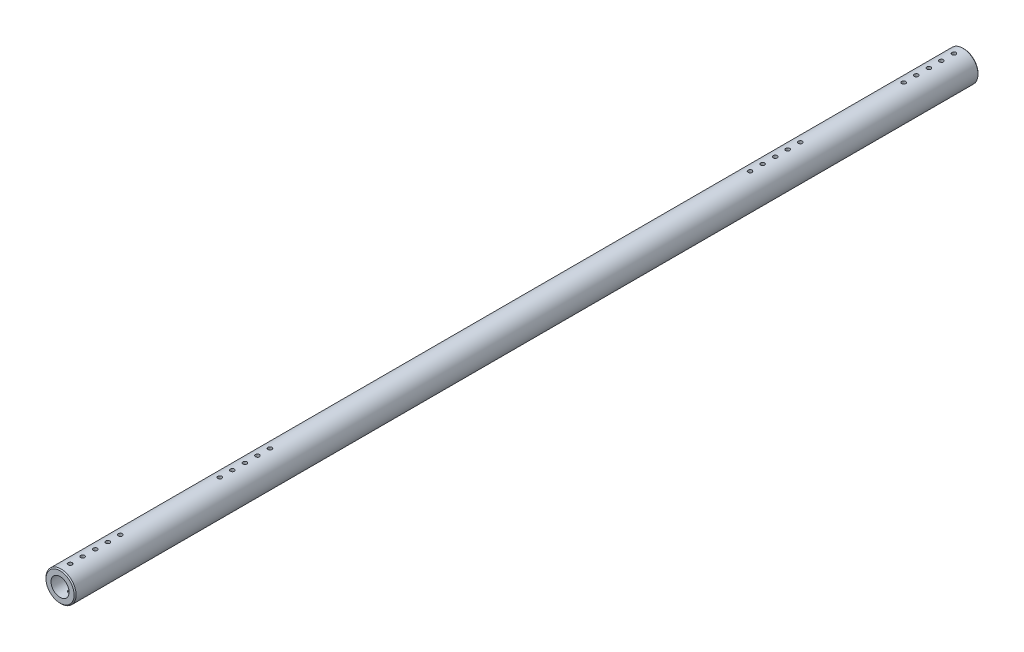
from build123d import *

# Parameters (mm, degrees)
ESQUISSE1_R                  = 15
ESQUISSE1_R_2                = 9
BASE_EXTRU_MINCE_DEPTH       = 900
CHANFREIN1_SIZE              = 1
ENL_V_MAT_EXTRU_1_DEPTH      = 50
ENL_V_MAT_EXTRU_1_DEPTH_BACK = 10
ESQUISSE2_R                  = 2


with BuildPart() as part:
    # Esquisse1 → Base-Extru.-Mince (new body)
    with BuildSketch(Plane.XY):
        Circle(ESQUISSE1_R)
        Circle(ESQUISSE1_R_2, mode=Mode.SUBTRACT)
    extrude(amount=BASE_EXTRU_MINCE_DEPTH)

    # Chanfrein1
    chanfrein1_edges = [part.edges().sort_by_distance(p)[0] for p in [
        (-15, 0, 0),
        (-15, 0, 900),
    ]]
    chamfer(chanfrein1_edges, length=CHANFREIN1_SIZE)

    # Esquisse2 → Enl_v. mat.-Extru.1 (cut, two sides: drawn at the far end of the back side and taken through both)
    with BuildSketch(Plane(origin=(0, 0, 0), x_dir=(1, 0, 0), z_dir=(0, 1, 0)).offset(-ENL_V_MAT_EXTRU_1_DEPTH_BACK)):
        with Locations(Location((0, -10, 0), (0, 0, 270))):
            Circle(ESQUISSE2_R)
        with Locations(Location((0, -22.5, 0), (0, 0, 270))):
            Circle(ESQUISSE2_R)
        with Locations(Location((0, -35, 0), (0, 0, 270))):
            Circle(ESQUISSE2_R)
        with Locations(Location((0, -163, 0), (0, 0, 270))):
            Circle(ESQUISSE2_R)
        with Locations(Location((0, -741, 0), (0, 0, 270))):
            Circle(ESQUISSE2_R)
        with Locations(Location((0, -865, 0), (0, 0, 270))):
            Circle(ESQUISSE2_R)
        with Locations(Location((0, -877.5, 0), (0, 0, 270))):
            Circle(ESQUISSE2_R)
        with Locations(Location((0, -890, 0), (0, 0, 270))):
            Circle(ESQUISSE2_R)
        with Locations(Location((0, -716, 0), (0, 0, 270))):
            Circle(ESQUISSE2_R)
        with Locations(Location((0, -47.5, 0), (0, 0, 270))):
            Circle(ESQUISSE2_R)
        with Locations(Location((0, -60, 0), (0, 0, 270))):
            Circle(ESQUISSE2_R)
        with Locations(Location((0, -852.5, 0), (0, 0, 270))):
            Circle(ESQUISSE2_R)
        with Locations(Location((0, -840, 0), (0, 0, 270))):
            Circle(ESQUISSE2_R)
        with Locations(Location((0, -728.5, 0), (0, 0, 270))):
            Circle(ESQUISSE2_R)
        with Locations(Location((0, -703.5, 0), (0, 0, 270))):
            Circle(ESQUISSE2_R)
        with Locations(Location((0, -691, 0), (0, 0, 270))):
            Circle(ESQUISSE2_R)
        with Locations(Location((0, -175.5, 0), (0, 0, 270))):
            Circle(ESQUISSE2_R)
        with Locations(Location((0, -188, 0), (0, 0, 270))):
            Circle(ESQUISSE2_R)
        with Locations(Location((0, -200.5, 0), (0, 0, 270))):
            Circle(ESQUISSE2_R)
        with Locations(Location((0, -213, 0), (0, 0, 270))):
            Circle(ESQUISSE2_R)
    extrude(amount=ENL_V_MAT_EXTRU_1_DEPTH + ENL_V_MAT_EXTRU_1_DEPTH_BACK, mode=Mode.SUBTRACT)


solid = part.part
